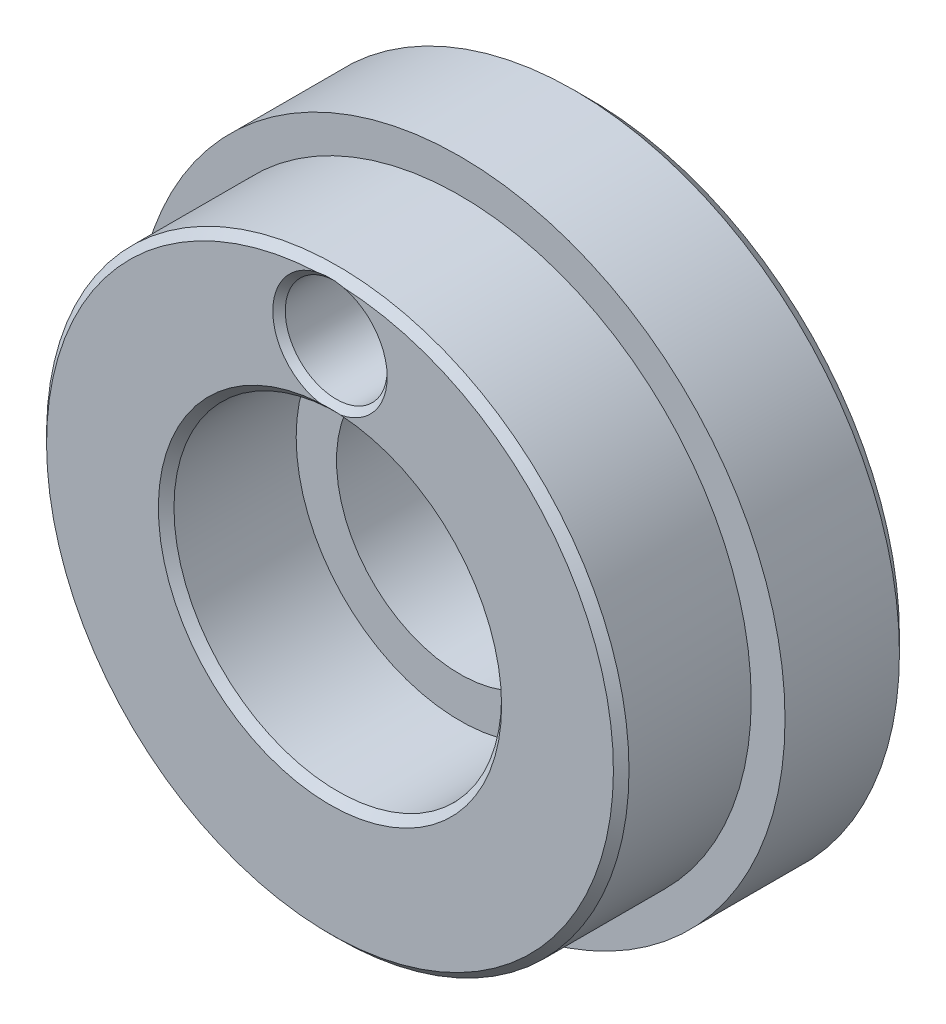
ISO-10303-21;
HEADER;
FILE_DESCRIPTION(('STEP AP214'),'2;1');
FILE_NAME('part.step','',(''),(''),'','','');
FILE_SCHEMA(('AUTOMOTIVE_DESIGN { 1 0 10303 214 1 1 1 1 }'));
ENDSEC;
DATA;
#1=APPLICATION_CONTEXT('core data for automotive mechanical design processes');
#2=APPLICATION_PROTOCOL_DEFINITION('international standard','automotive_design',2000,#1);
#3=PRODUCT_CONTEXT('',#1,'mechanical');
#4=PRODUCT('Part','Part','',(#3));
#5=PRODUCT_RELATED_PRODUCT_CATEGORY('part','',(#4));
#6=PRODUCT_DEFINITION_FORMATION('','',#4);
#7=PRODUCT_DEFINITION_CONTEXT('part definition',#1,'design');
#8=PRODUCT_DEFINITION('design','',#6,#7);
#9=PRODUCT_DEFINITION_SHAPE('','',#8);
#10=(LENGTH_UNIT() NAMED_UNIT(*) SI_UNIT(.MILLI.,.METRE.));
#11=(NAMED_UNIT(*) PLANE_ANGLE_UNIT() SI_UNIT($,.RADIAN.));
#12=(NAMED_UNIT(*) SI_UNIT($,.STERADIAN.) SOLID_ANGLE_UNIT());
#13=UNCERTAINTY_MEASURE_WITH_UNIT(LENGTH_MEASURE(1.E-05),#10,'distance_accuracy_value','');
#14=(GEOMETRIC_REPRESENTATION_CONTEXT(3) GLOBAL_UNCERTAINTY_ASSIGNED_CONTEXT((#13)) GLOBAL_UNIT_ASSIGNED_CONTEXT((#10,
#11,#12)) REPRESENTATION_CONTEXT('',''));
#15=CARTESIAN_POINT('',(0.,0.,0.));
#16=DIRECTION('',(0.,0.,1.));
#17=DIRECTION('',(1.,0.,0.));
#18=AXIS2_PLACEMENT_3D('',#15,#16,#17);
#19=CARTESIAN_POINT('',(0.,0.,12.7));
#20=DIRECTION('',(0.,0.,-1.));
#21=DIRECTION('',(-1.,0.,0.));
#22=AXIS2_PLACEMENT_3D('',#19,#20,#21);
#23=CYLINDRICAL_SURFACE('',#22,15.875);
#24=CARTESIAN_POINT('',(0.,0.,0.761999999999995));
#25=DIRECTION('',(0.,0.,1.));
#26=DIRECTION('',(1.,0.,0.));
#27=AXIS2_PLACEMENT_3D('',#24,#25,#26);
#28=CIRCLE('',#27,15.875);
#29=CARTESIAN_POINT('',(15.875,0.,0.761999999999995));
#30=VERTEX_POINT('',#29);
#31=EDGE_CURVE('E96',#30,#30,#28,.T.);
#32=ORIENTED_EDGE('',*,*,#31,.T.);
#33=EDGE_LOOP('',(#32));
#34=FACE_BOUND('',#33,.T.);
#35=CARTESIAN_POINT('',(0.,0.,6.35));
#36=DIRECTION('',(0.,0.,1.));
#37=DIRECTION('',(1.,0.,0.));
#38=AXIS2_PLACEMENT_3D('',#35,#36,#37);
#39=CIRCLE('',#38,15.875);
#40=CARTESIAN_POINT('',(15.875,0.,6.35));
#41=VERTEX_POINT('',#40);
#42=EDGE_CURVE('E93',#41,#41,#39,.T.);
#43=ORIENTED_EDGE('',*,*,#42,.F.);
#44=EDGE_LOOP('',(#43));
#45=FACE_BOUND('',#44,.T.);
#46=ADVANCED_FACE('F34',(#34,#45),#23,.T.);
#47=CARTESIAN_POINT('',(0.,0.,0.));
#48=DIRECTION('',(0.,0.,1.));
#49=DIRECTION('',(1.,0.,0.));
#50=AXIS2_PLACEMENT_3D('',#47,#48,#49);
#51=PLANE('',#50);
#52=CARTESIAN_POINT('',(0.,0.,0.));
#53=DIRECTION('',(0.,0.,1.));
#54=DIRECTION('',(1.,0.,0.));
#55=AXIS2_PLACEMENT_3D('',#52,#53,#54);
#56=CIRCLE('',#55,15.113);
#57=CARTESIAN_POINT('',(15.113,0.,0.));
#58=VERTEX_POINT('',#57);
#59=EDGE_CURVE('E99',#58,#58,#56,.F.);
#60=ORIENTED_EDGE('',*,*,#59,.T.);
#61=EDGE_LOOP('',(#60));
#62=FACE_BOUND('',#61,.T.);
#63=CARTESIAN_POINT('',(0.,0.,0.));
#64=DIRECTION('',(0.,0.,1.));
#65=DIRECTION('',(1.,0.,0.));
#66=AXIS2_PLACEMENT_3D('',#63,#64,#65);
#67=CIRCLE('',#66,6.0325);
#68=CARTESIAN_POINT('',(6.0325,0.,0.));
#69=VERTEX_POINT('',#68);
#70=EDGE_CURVE('E78',#69,#69,#67,.T.);
#71=ORIENTED_EDGE('',*,*,#70,.T.);
#72=EDGE_LOOP('',(#71));
#73=FACE_BOUND('',#72,.T.);
#74=ADVANCED_FACE('F149',(#62,#73),#51,.F.);
#75=CARTESIAN_POINT('',(0.,0.,6.35));
#76=DIRECTION('',(0.,0.,1.));
#77=DIRECTION('',(1.,0.,0.));
#78=AXIS2_PLACEMENT_3D('',#75,#76,#77);
#79=PLANE('',#78);
#80=CARTESIAN_POINT('',(0.,0.,6.35));
#81=DIRECTION('',(0.,0.,1.));
#82=DIRECTION('',(1.,0.,0.));
#83=AXIS2_PLACEMENT_3D('',#80,#81,#82);
#84=CIRCLE('',#83,14.224);
#85=CARTESIAN_POINT('',(14.224,0.,6.35));
#86=VERTEX_POINT('',#85);
#87=EDGE_CURVE('E90',#86,#86,#84,.T.);
#88=ORIENTED_EDGE('',*,*,#87,.F.);
#89=EDGE_LOOP('',(#88));
#90=FACE_BOUND('',#89,.T.);
#91=ORIENTED_EDGE('',*,*,#42,.T.);
#92=EDGE_LOOP('',(#91));
#93=FACE_BOUND('',#92,.T.);
#94=ADVANCED_FACE('F145',(#90,#93),#79,.T.);
#95=CARTESIAN_POINT('',(0.,0.,6.35));
#96=DIRECTION('',(0.,0.,1.));
#97=DIRECTION('',(1.,0.,0.));
#98=AXIS2_PLACEMENT_3D('',#95,#96,#97);
#99=CYLINDRICAL_SURFACE('',#98,14.224);
#100=CARTESIAN_POINT('',(0.,0.,12.319));
#101=DIRECTION('',(0.,0.,1.));
#102=DIRECTION('',(1.,0.,0.));
#103=AXIS2_PLACEMENT_3D('',#100,#101,#102);
#104=CIRCLE('',#103,14.224);
#105=CARTESIAN_POINT('',(14.224,0.,12.319));
#106=VERTEX_POINT('',#105);
#107=EDGE_CURVE('E11',#106,#106,#104,.F.);
#108=ORIENTED_EDGE('',*,*,#107,.T.);
#109=EDGE_LOOP('',(#108));
#110=FACE_BOUND('',#109,.T.);
#111=ORIENTED_EDGE('',*,*,#87,.T.);
#112=EDGE_LOOP('',(#111));
#113=FACE_BOUND('',#112,.T.);
#114=ADVANCED_FACE('F142',(#110,#113),#99,.T.);
#115=CARTESIAN_POINT('',(0.,0.,12.7));
#116=DIRECTION('',(0.,0.,1.));
#117=DIRECTION('',(1.,0.,0.));
#118=AXIS2_PLACEMENT_3D('',#115,#116,#117);
#119=PLANE('',#118);
#120=CARTESIAN_POINT('',(0.,11.1125,12.7));
#121=DIRECTION('',(0.,0.,1.));
#122=DIRECTION('',(1.,0.,0.));
#123=AXIS2_PLACEMENT_3D('',#120,#121,#122);
#124=CIRCLE('',#123,2.794);
#125=CARTESIAN_POINT('',(0.514158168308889,8.36621571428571,12.7));
#126=VERTEX_POINT('',#125);
#127=CARTESIAN_POINT('',(0.66087411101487,13.8272157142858,12.7));
#128=VERTEX_POINT('',#127);
#129=EDGE_CURVE('E179',#126,#128,#124,.T.);
#130=ORIENTED_EDGE('',*,*,#129,.F.);
#131=CARTESIAN_POINT('',(0.,0.,12.7));
#132=DIRECTION('',(0.,0.,1.));
#133=DIRECTION('',(1.,0.,0.));
#134=AXIS2_PLACEMENT_3D('',#131,#132,#133);
#135=CIRCLE('',#134,8.38199999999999);
#136=CARTESIAN_POINT('',(-0.514158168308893,8.36621571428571,12.7));
#137=VERTEX_POINT('',#136);
#138=EDGE_CURVE('E108',#126,#137,#135,.F.);
#139=ORIENTED_EDGE('',*,*,#138,.T.);
#140=CARTESIAN_POINT('',(-0.660874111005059,13.8272157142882,12.7));
#141=VERTEX_POINT('',#140);
#142=EDGE_CURVE('E81',#141,#137,#124,.T.);
#143=ORIENTED_EDGE('',*,*,#142,.F.);
#144=CARTESIAN_POINT('',(0.,0.,12.7));
#145=DIRECTION('',(0.,0.,1.));
#146=DIRECTION('',(1.,0.,0.));
#147=AXIS2_PLACEMENT_3D('',#144,#145,#146);
#148=CIRCLE('',#147,13.843);
#149=EDGE_CURVE('E105',#141,#128,#148,.T.);
#150=ORIENTED_EDGE('',*,*,#149,.T.);
#151=EDGE_LOOP('',(#130,#139,#143,#150));
#152=FACE_BOUND('',#151,.T.);
#153=ADVANCED_FACE('F140',(#152),#119,.T.);
#154=CARTESIAN_POINT('',(0.,0.,6.35));
#155=DIRECTION('',(0.,0.,1.));
#156=DIRECTION('',(1.,0.,0.));
#157=AXIS2_PLACEMENT_3D('',#154,#155,#156);
#158=CYLINDRICAL_SURFACE('',#157,8.001);
#159=CARTESIAN_POINT('',(0.,0.,12.319));
#160=DIRECTION('',(0.,0.,1.));
#161=DIRECTION('',(1.,0.,0.));
#162=AXIS2_PLACEMENT_3D('',#159,#160,#161);
#163=CIRCLE('',#162,8.001);
#164=CARTESIAN_POINT('',(8.001,0.,12.319));
#165=VERTEX_POINT('',#164);
#166=EDGE_CURVE('E102',#165,#165,#163,.T.);
#167=ORIENTED_EDGE('',*,*,#166,.T.);
#168=EDGE_LOOP('',(#167));
#169=FACE_BOUND('',#168,.T.);
#170=CARTESIAN_POINT('',(0.,0.,6.35));
#171=DIRECTION('',(0.,0.,1.));
#172=DIRECTION('',(1.,0.,0.));
#173=AXIS2_PLACEMENT_3D('',#170,#171,#172);
#174=CIRCLE('',#173,8.001);
#175=CARTESIAN_POINT('',(8.001,0.,6.35));
#176=VERTEX_POINT('',#175);
#177=EDGE_CURVE('E86',#176,#176,#174,.T.);
#178=ORIENTED_EDGE('',*,*,#177,.F.);
#179=EDGE_LOOP('',(#178));
#180=FACE_BOUND('',#179,.T.);
#181=ADVANCED_FACE('F136',(#169,#180),#158,.F.);
#182=CARTESIAN_POINT('',(0.,0.,6.35));
#183=DIRECTION('',(0.,0.,1.));
#184=DIRECTION('',(1.,0.,0.));
#185=AXIS2_PLACEMENT_3D('',#182,#183,#184);
#186=PLANE('',#185);
#187=CARTESIAN_POINT('',(0.,0.,6.35));
#188=DIRECTION('',(0.,0.,1.));
#189=DIRECTION('',(1.,0.,0.));
#190=AXIS2_PLACEMENT_3D('',#187,#188,#189);
#191=CIRCLE('',#190,6.0325);
#192=CARTESIAN_POINT('',(6.0325,0.,6.35));
#193=VERTEX_POINT('',#192);
#194=EDGE_CURVE('E74',#193,#193,#191,.T.);
#195=ORIENTED_EDGE('',*,*,#194,.F.);
#196=EDGE_LOOP('',(#195));
#197=FACE_BOUND('',#196,.T.);
#198=ORIENTED_EDGE('',*,*,#177,.T.);
#199=EDGE_LOOP('',(#198));
#200=FACE_BOUND('',#199,.T.);
#201=ADVANCED_FACE('F132',(#197,#200),#186,.T.);
#202=CARTESIAN_POINT('',(0.,0.,0.));
#203=DIRECTION('',(0.,0.,1.));
#204=DIRECTION('',(1.,0.,0.));
#205=AXIS2_PLACEMENT_3D('',#202,#203,#204);
#206=CYLINDRICAL_SURFACE('',#205,6.0325);
#207=ORIENTED_EDGE('',*,*,#70,.F.);
#208=EDGE_LOOP('',(#207));
#209=FACE_BOUND('',#208,.T.);
#210=ORIENTED_EDGE('',*,*,#194,.T.);
#211=EDGE_LOOP('',(#210));
#212=FACE_BOUND('',#211,.T.);
#213=ADVANCED_FACE('F129',(#209,#212),#206,.F.);
#214=CARTESIAN_POINT('',(0.,0.,0.761999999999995));
#215=DIRECTION('',(0.,0.,1.));
#216=DIRECTION('',(1.,0.,0.));
#217=AXIS2_PLACEMENT_3D('',#214,#215,#216);
#218=CONICAL_SURFACE('',#217,15.875,0.785398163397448);
#219=ORIENTED_EDGE('',*,*,#59,.F.);
#220=EDGE_LOOP('',(#219));
#221=FACE_BOUND('',#220,.T.);
#222=ORIENTED_EDGE('',*,*,#31,.F.);
#223=EDGE_LOOP('',(#222));
#224=FACE_BOUND('',#223,.T.);
#225=ADVANCED_FACE('F68',(#221,#224),#218,.T.);
#226=CARTESIAN_POINT('',(0.,11.1125,3.81));
#227=DIRECTION('',(0.,0.,1.));
#228=DIRECTION('',(1.,0.,0.));
#229=AXIS2_PLACEMENT_3D('',#226,#227,#228);
#230=CONICAL_SURFACE('',#229,2.4892,1.02974425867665);
#231=CARTESIAN_POINT('',(0.,11.1125,2.3143377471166));
#232=VERTEX_POINT('',#231);
#233=VERTEX_LOOP('',#232);
#234=FACE_BOUND('',#233,.T.);
#235=CARTESIAN_POINT('',(0.,11.1125,3.81));
#236=DIRECTION('',(0.,0.,1.));
#237=DIRECTION('',(1.,0.,0.));
#238=AXIS2_PLACEMENT_3D('',#235,#236,#237);
#239=CIRCLE('',#238,2.4892);
#240=CARTESIAN_POINT('',(2.4892,11.1125,3.81));
#241=VERTEX_POINT('',#240);
#242=EDGE_CURVE('E72',#241,#241,#239,.T.);
#243=ORIENTED_EDGE('',*,*,#242,.T.);
#244=EDGE_LOOP('',(#243));
#245=FACE_BOUND('',#244,.T.);
#246=ADVANCED_FACE('F64',(#234,#245),#230,.F.);
#247=CARTESIAN_POINT('',(0.,11.1125,12.7));
#248=DIRECTION('',(0.,0.,1.));
#249=DIRECTION('',(1.,0.,0.));
#250=AXIS2_PLACEMENT_3D('',#247,#248,#249);
#251=CYLINDRICAL_SURFACE('',#250,2.4892);
#252=ORIENTED_EDGE('',*,*,#242,.F.);
#253=EDGE_LOOP('',(#252));
#254=FACE_BOUND('',#253,.T.);
#255=CARTESIAN_POINT('',(0.,11.1125,12.3952));
#256=DIRECTION('',(0.,0.,1.));
#257=DIRECTION('',(1.,0.,0.));
#258=AXIS2_PLACEMENT_3D('',#255,#256,#257);
#259=CIRCLE('',#258,2.4892);
#260=CARTESIAN_POINT('',(2.4892,11.1125,12.3952));
#261=VERTEX_POINT('',#260);
#262=EDGE_CURVE('E75',#261,#261,#259,.T.);
#263=ORIENTED_EDGE('',*,*,#262,.T.);
#264=EDGE_LOOP('',(#263));
#265=FACE_BOUND('',#264,.T.);
#266=ADVANCED_FACE('F67',(#254,#265),#251,.F.);
#267=CARTESIAN_POINT('',(0.,11.1125,12.7));
#268=DIRECTION('',(0.,0.,1.));
#269=DIRECTION('',(1.,0.,0.));
#270=AXIS2_PLACEMENT_3D('',#267,#268,#269);
#271=CONICAL_SURFACE('',#270,2.794,0.785398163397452);
#272=ORIENTED_EDGE('',*,*,#262,.F.);
#273=EDGE_LOOP('',(#272));
#274=FACE_BOUND('',#273,.T.);
#275=ORIENTED_EDGE('',*,*,#142,.T.);
#276=CARTESIAN_POINT('',(-0.514158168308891,8.36621571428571,12.7));
#277=CARTESIAN_POINT('',(-0.342772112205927,8.3555719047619,12.6788333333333));
#278=CARTESIAN_POINT('',(-0.171386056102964,8.35025,12.66825));
#279=CARTESIAN_POINT('',(0.171386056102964,8.35025,12.66825));
#280=CARTESIAN_POINT('',(0.342772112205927,8.3555719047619,12.6788333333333));
#281=CARTESIAN_POINT('',(0.514158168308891,8.36621571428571,12.7));
#282=B_SPLINE_CURVE_WITH_KNOTS('',3,(#276,#277,#278,#279,#280,#281),.UNSPECIFIED.,.F.,.F.,(4,2,
4),(0.,0.515384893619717,1.03076978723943),.UNSPECIFIED.);
#283=EDGE_CURVE('E43',#137,#126,#282,.T.);
#284=ORIENTED_EDGE('',*,*,#283,.T.);
#285=ORIENTED_EDGE('',*,*,#129,.T.);
#286=CARTESIAN_POINT('',(0.660874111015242,13.8272157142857,12.7));
#287=CARTESIAN_POINT('',(0.551416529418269,13.8430350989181,12.689433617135));
#288=CARTESIAN_POINT('',(0.441133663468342,13.8549482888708,12.6814763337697));
#289=CARTESIAN_POINT('',(0.220563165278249,13.8707765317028,12.670904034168));
#290=CARTESIAN_POINT('',(0.110281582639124,13.87475,12.66825));
#291=CARTESIAN_POINT('',(-0.110281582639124,13.87475,12.66825));
#292=CARTESIAN_POINT('',(-0.220563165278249,13.8707765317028,12.670904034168));
#293=CARTESIAN_POINT('',(-0.441133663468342,13.8549482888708,12.6814763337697));
#294=CARTESIAN_POINT('',(-0.55141652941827,13.8430350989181,12.689433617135));
#295=CARTESIAN_POINT('',(-0.660874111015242,13.8272157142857,12.7));
#296=B_SPLINE_CURVE_WITH_KNOTS('',3,(#286,#287,#288,#289,#290,#291,#292,#293,#294,#295),
.UNSPECIFIED.,.F.,.F.,(4,2,2,2,4),(0.,0.333207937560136,0.663955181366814,0.994702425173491,
1.32791036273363),.UNSPECIFIED.);
#297=EDGE_CURVE('E110',#128,#141,#296,.T.);
#298=ORIENTED_EDGE('',*,*,#297,.T.);
#299=EDGE_LOOP('',(#275,#284,#285,#298));
#300=FACE_BOUND('',#299,.T.);
#301=ADVANCED_FACE('F120',(#274,#300),#271,.F.);
#302=CARTESIAN_POINT('',(0.,0.,12.319));
#303=DIRECTION('',(0.,0.,1.));
#304=DIRECTION('',(1.,0.,0.));
#305=AXIS2_PLACEMENT_3D('',#302,#303,#304);
#306=CONICAL_SURFACE('',#305,8.001,0.785398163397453);
#307=ORIENTED_EDGE('',*,*,#283,.F.);
#308=ORIENTED_EDGE('',*,*,#138,.F.);
#309=EDGE_LOOP('',(#307,#308));
#310=FACE_BOUND('',#309,.T.);
#311=ORIENTED_EDGE('',*,*,#166,.F.);
#312=EDGE_LOOP('',(#311));
#313=FACE_BOUND('',#312,.T.);
#314=ADVANCED_FACE('F124',(#310,#313),#306,.F.);
#315=CARTESIAN_POINT('',(0.,0.,12.7));
#316=DIRECTION('',(0.,0.,-1.));
#317=DIRECTION('',(-1.,0.,0.));
#318=AXIS2_PLACEMENT_3D('',#315,#316,#317);
#319=CONICAL_SURFACE('',#318,13.843,0.785398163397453);
#320=ORIENTED_EDGE('',*,*,#107,.F.);
#321=EDGE_LOOP('',(#320));
#322=FACE_BOUND('',#321,.T.);
#323=ORIENTED_EDGE('',*,*,#297,.F.);
#324=ORIENTED_EDGE('',*,*,#149,.F.);
#325=EDGE_LOOP('',(#323,#324));
#326=FACE_BOUND('',#325,.T.);
#327=ADVANCED_FACE('F36',(#322,#326),#319,.T.);
#328=CLOSED_SHELL('',(#46,#74,#94,#114,#153,#181,#201,#213,#225,#246,#266,#301,#314,#327));
#329=MANIFOLD_SOLID_BREP('B2',#328);
#330=ADVANCED_BREP_SHAPE_REPRESENTATION('',(#18,#329),#14);
#331=SHAPE_DEFINITION_REPRESENTATION(#9,#330);
ENDSEC;
END-ISO-10303-21;
